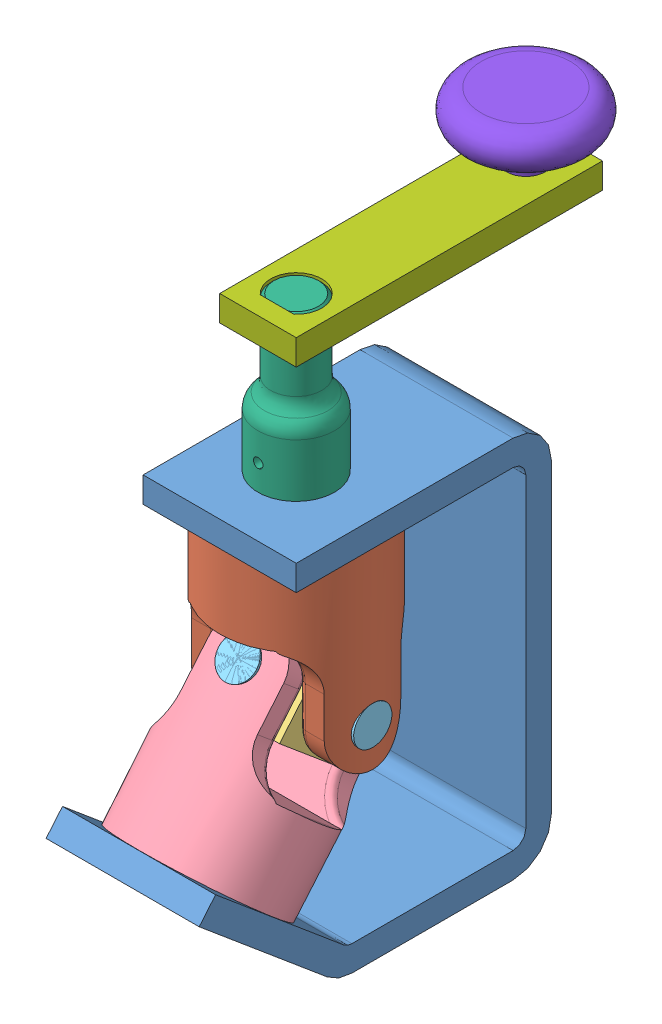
SolidWorks assembly Changes.SLDASM, configuration Default (file format 15000). Lengths in mm.
Overall size (44.81 150.22 122.75).
11 component instances, 8 part files, 16 mates.
Components (placement in the parent):
- bracket-1: bracket.sldprt [Default] at origin size (38.1 95.25 87.65)
- Yoke_male-1: Yoke_male.sldprt [Default] at (0 34.925 38.1) x (0 0 1) z (-1 0 0) size (38.1 66.67 38.1)
- spider-1: spider.sldprt [Default] at (0 44.45 38.1) x (-1 0 0) z (0 0.642788 0.766044) size (20.32 20.32 20.32)
- Yoke_female-1: Yoke_female.sldprt [Default] at (0 51.7466 31.9774) x (1 0 0) z (0 -0.642788 -0.766044) size (38.1 47.62 38.1)
- pin-1: pin.SLDPRT [Long] at (19.05 44.45 38.1) x (0 0.081798 0.996649) z (-1 0 0) size (9.53 9.53 38.1)
- pin-2: pin.SLDPRT [Long] at (0 32.2049 23.5069) x (0.999817 0.01465 -0.012293) z (0 0.642788 0.766044) size (9.53 9.53 38.1)
- pin-3: pin.SLDPRT [Long] at (0 32.2049 23.5069) x (0.97863 -0.15752 0.132175) z (0 0.642788 0.766044) size (9.53 9.53 38.1)
- crank-assy-1: crank-assy.sldasm [Default] at (0 89.9 38.1) x (0 0 1) z (-1 0 0) size (89.08 53.98 44.81)
  - crank-shaft-1: crank-shaft.sldprt [Default] at origin size (19.05 38.1 19.05)
  - crank-arm-1: crank-arm.sldprt [Default] at (-66.675 31.75 -9.525) size (76.2 6.35 19.05)
  - crank-knob-1: crank-knob.sldprt [Default] at (-57.15 31.75 0) x (0.661436 0 -0.750001) z (0.750001 0 0.661436) size (31.75 22.23 31.75)
Mates (geometry in assembly coordinates):
- Concentric1: concentric anti-aligned: cylinder of bracket-1 through (0 -6.351 38.1) axis (0 1 0) radius 6.35; cylinder of Yoke_male-1 through (0 101.6 38.1) axis (0 -1 0) radius 6.35
- Coincident1: coincident anti-aligned: plane of bracket-1 through (19.05 82.55 3.175) normal (0 -1 0); plane of Yoke_male-1 through (0 82.55 38.1) normal (0 1 0)
- Concentric2: concentric aligned: cylinder of Yoke_male-1 through (19.05 44.45 38.1) axis (-1 0 0) radius 4.7625; cylinder of spider-1 through (10.16 44.45 38.1) axis (-1 0 0) radius 4.7625
- Coincident2: coincident anti-aligned: plane of Yoke_male-1 through (-10.16 27.4697 19.05) normal (1 0 0); plane of spider-1 through (-10.16 43.1977 52.4137) normal (-1 0 0)
- Concentric3: concentric aligned: cylinder of spider-1 through (0 50.9807 45.883) axis (0 -0.642788 -0.766044) radius 4.7625; cylinder of Yoke_female-1 through (0 56.6951 52.6931) axis (0 -0.642788 -0.766044) radius 4.7625
- Coincident3: coincident anti-aligned: plane of spider-1 through (10.16 43.1977 52.4137) normal (0 0.642788 0.766044); plane of Yoke_female-1 through (89.8902 35.9507 58.4947) normal (0 -0.642788 -0.766044)
- Parallel1: parallel anti-aligned: plane of bracket-1 through (19.05 27.4943 77.2165) normal (0 0.766044 -0.642788); plane of Yoke_female-1 through (0 15.2637 62.5902) normal (0 -0.766044 0.642788)
- Concentric4: concentric anti-aligned: cylinder of Yoke_male-1 through (19.05 44.45 38.1) axis (-1 0 0) radius 4.7625; cylinder of pin-1 through (-19.05 44.45 38.1) axis (1 0 0) radius 4.7625
- Tangent1: tangent aligned: cylinder of Yoke_male-1 through (0 82.55 38.1) axis (0 -1 0) radius 19.05; plane of pin-1 through (19.05 44.45 38.1) normal (1 0 0)
- Concentric5: concentric aligned: cylinder of Yoke_female-1 through (0 56.6951 52.6931) axis (0 -0.642788 -0.766044) radius 4.7625; cylinder of pin-2 through (0 56.6951 52.6931) axis (0 -0.642788 -0.766044) radius 4.7625
- Tangent2: tangent aligned: cylinder of Yoke_female-1 through (0 15.2637 62.5902) axis (0 0.766044 -0.642788) radius 19.05; plane of pin-2 through (0 56.6951 52.6931) normal (0 0.642788 0.766044)
- Concentric6: concentric aligned: cylinder of Yoke_female-1 through (0 56.6951 52.6931) axis (0 -0.642788 -0.766044) radius 4.7625; cylinder of pin-3 through (0 56.6951 52.6931) axis (0 -0.642788 -0.766044) radius 4.7625
- Tangent3: tangent aligned: cylinder of Yoke_female-1 through (0 15.2637 62.5902) axis (0 0.766044 -0.642788) radius 19.05; plane of pin-3 through (0 32.2049 23.5069) normal (0 -0.642788 -0.766044)
- Concentric7: concentric aligned: cylinder of Yoke_male-1 through (0 101.6 38.1) axis (0 -1 0) radius 6.35; cylinder of crank-assy-1/crank-shaft-1 through (0 102.6 38.1) axis (0 -1 0) radius 6.35
- Parallel2: parallel anti-aligned: plane of Yoke_male-1 through (-4.2001 88.9 42.8625) normal (0 0 1); plane of crank-assy-1/crank-shaft-1 through (-4.2001 102.6 42.8625) normal (0 0 -1)
- Distance1: distance = 1 mm anti-aligned: plane of bracket-1 through (19.05 88.9 3.175) normal (0 1 0); plane of crank-assy-1/crank-shaft-1 through (0 89.9 38.1) normal (0 -1 0)
